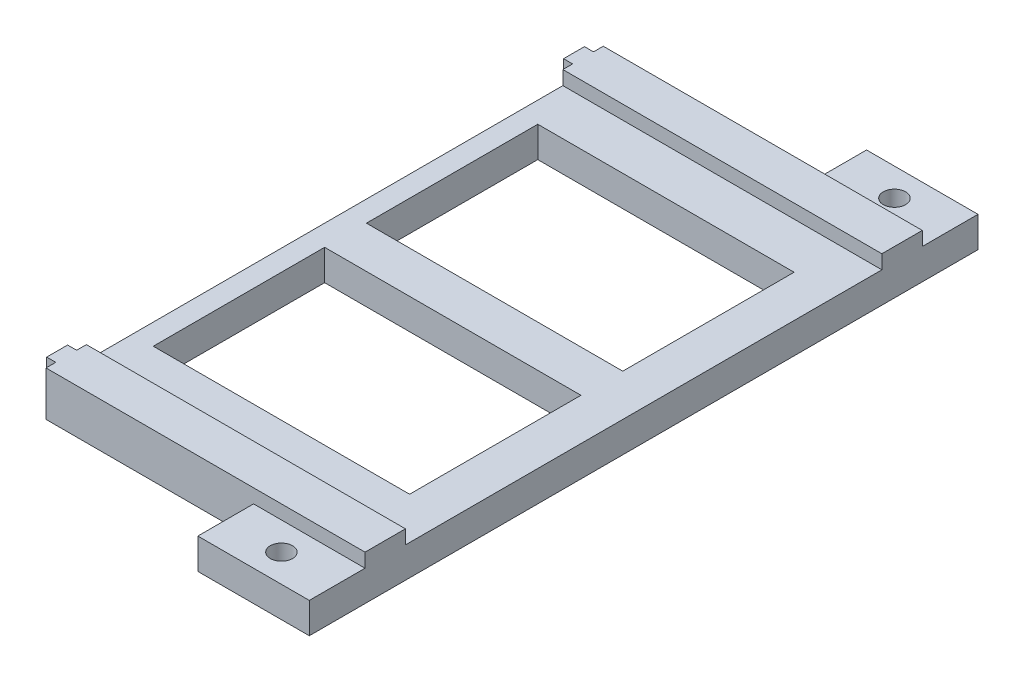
ISO-10303-21;
HEADER;
FILE_DESCRIPTION(('STEP AP214'),'2;1');
FILE_NAME('part.step','',(''),(''),'','','');
FILE_SCHEMA(('AUTOMOTIVE_DESIGN { 1 0 10303 214 1 1 1 1 }'));
ENDSEC;
DATA;
#1=APPLICATION_CONTEXT('core data for automotive mechanical design processes');
#2=APPLICATION_PROTOCOL_DEFINITION('international standard','automotive_design',2000,#1);
#3=PRODUCT_CONTEXT('',#1,'mechanical');
#4=PRODUCT('Part','Part','',(#3));
#5=PRODUCT_RELATED_PRODUCT_CATEGORY('part','',(#4));
#6=PRODUCT_DEFINITION_FORMATION('','',#4);
#7=PRODUCT_DEFINITION_CONTEXT('part definition',#1,'design');
#8=PRODUCT_DEFINITION('design','',#6,#7);
#9=PRODUCT_DEFINITION_SHAPE('','',#8);
#10=(LENGTH_UNIT() NAMED_UNIT(*) SI_UNIT(.MILLI.,.METRE.));
#11=(NAMED_UNIT(*) PLANE_ANGLE_UNIT() SI_UNIT($,.RADIAN.));
#12=(NAMED_UNIT(*) SI_UNIT($,.STERADIAN.) SOLID_ANGLE_UNIT());
#13=UNCERTAINTY_MEASURE_WITH_UNIT(LENGTH_MEASURE(1.E-05),#10,'distance_accuracy_value','');
#14=(GEOMETRIC_REPRESENTATION_CONTEXT(3) GLOBAL_UNCERTAINTY_ASSIGNED_CONTEXT((#13)) GLOBAL_UNIT_ASSIGNED_CONTEXT((#10,
#11,#12)) REPRESENTATION_CONTEXT('',''));
#15=CARTESIAN_POINT('',(0.,0.,0.));
#16=DIRECTION('',(0.,0.,1.));
#17=DIRECTION('',(1.,0.,0.));
#18=AXIS2_PLACEMENT_3D('',#15,#16,#17);
#19=CARTESIAN_POINT('',(70.,0.,122.02168738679));
#20=DIRECTION('',(1.,0.,0.));
#21=DIRECTION('',(0.,0.,-1.));
#22=AXIS2_PLACEMENT_3D('',#19,#20,#21);
#23=PLANE('',#22);
#24=DIRECTION('',(0.,1.,0.));
#25=VECTOR('',#24,1.);
#26=CARTESIAN_POINT('',(70.,-8.17389136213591,-89.));
#27=LINE('',#26,#25);
#28=CARTESIAN_POINT('',(70.,0.,-89.));
#29=VERTEX_POINT('',#28);
#30=CARTESIAN_POINT('',(70.,16.,-89.));
#31=VERTEX_POINT('',#30);
#32=EDGE_CURVE('E277',#29,#31,#27,.T.);
#33=ORIENTED_EDGE('',*,*,#32,.F.);
#34=DIRECTION('',(0.,0.,-1.));
#35=VECTOR('',#34,1.);
#36=CARTESIAN_POINT('',(70.,0.,122.02168738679));
#37=LINE('',#36,#35);
#38=CARTESIAN_POINT('',(70.,0.,89.));
#39=VERTEX_POINT('',#38);
#40=EDGE_CURVE('E321',#39,#29,#37,.T.);
#41=ORIENTED_EDGE('',*,*,#40,.F.);
#42=DIRECTION('',(0.,1.,0.));
#43=VECTOR('',#42,1.);
#44=CARTESIAN_POINT('',(70.,-8.17389136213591,89.));
#45=LINE('',#44,#43);
#46=CARTESIAN_POINT('',(70.,16.,89.));
#47=VERTEX_POINT('',#46);
#48=EDGE_CURVE('E309',#39,#47,#45,.T.);
#49=ORIENTED_EDGE('',*,*,#48,.T.);
#50=DIRECTION('',(0.,0.,1.));
#51=VECTOR('',#50,1.);
#52=CARTESIAN_POINT('',(70.,16.,0.));
#53=LINE('',#52,#51);
#54=CARTESIAN_POINT('',(70.,16.,85.5));
#55=VERTEX_POINT('',#54);
#56=EDGE_CURVE('E325',#55,#47,#53,.T.);
#57=ORIENTED_EDGE('',*,*,#56,.F.);
#58=DIRECTION('',(0.,1.,0.));
#59=VECTOR('',#58,1.);
#60=CARTESIAN_POINT('',(70.,65.,85.5));
#61=LINE('',#60,#59);
#62=CARTESIAN_POINT('',(70.,11.,85.5));
#63=VERTEX_POINT('',#62);
#64=EDGE_CURVE('E11',#63,#55,#61,.T.);
#65=ORIENTED_EDGE('',*,*,#64,.F.);
#66=DIRECTION('',(0.,0.,-1.));
#67=VECTOR('',#66,1.);
#68=CARTESIAN_POINT('',(70.,11.,0.));
#69=LINE('',#68,#67);
#70=CARTESIAN_POINT('',(70.,11.,-85.5));
#71=VERTEX_POINT('',#70);
#72=EDGE_CURVE('E320',#63,#71,#69,.T.);
#73=ORIENTED_EDGE('',*,*,#72,.T.);
#74=DIRECTION('',(0.,1.,0.));
#75=VECTOR('',#74,1.);
#76=CARTESIAN_POINT('',(70.,65.,-85.5));
#77=LINE('',#76,#75);
#78=CARTESIAN_POINT('',(70.,16.,-85.5));
#79=VERTEX_POINT('',#78);
#80=EDGE_CURVE('E329',#71,#79,#77,.T.);
#81=ORIENTED_EDGE('',*,*,#80,.T.);
#82=DIRECTION('',(0.,0.,1.));
#83=VECTOR('',#82,1.);
#84=CARTESIAN_POINT('',(70.,16.,0.));
#85=LINE('',#84,#83);
#86=EDGE_CURVE('E337',#31,#79,#85,.T.);
#87=ORIENTED_EDGE('',*,*,#86,.F.);
#88=EDGE_LOOP('',(#33,#41,#49,#57,#65,#73,#81,#87));
#89=FACE_BOUND('',#88,.T.);
#90=ADVANCED_FACE('F45',(#89),#23,.F.);
#91=DIRECTION('',(0.,1.,0.));
#92=VECTOR('',#91,1.);
#93=CARTESIAN_POINT('',(70.,-8.17389136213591,-96.5));
#94=LINE('',#93,#92);
#95=CARTESIAN_POINT('',(70.,0.,-96.5));
#96=VERTEX_POINT('',#95);
#97=CARTESIAN_POINT('',(70.,16.,-96.5));
#98=VERTEX_POINT('',#97);
#99=EDGE_CURVE('E257',#96,#98,#94,.T.);
#100=ORIENTED_EDGE('',*,*,#99,.T.);
#101=CARTESIAN_POINT('',(70.,16.,-100.));
#102=VERTEX_POINT('',#101);
#103=EDGE_CURVE('E338',#102,#98,#85,.T.);
#104=ORIENTED_EDGE('',*,*,#103,.F.);
#105=DIRECTION('',(0.,1.,0.));
#106=VECTOR('',#105,1.);
#107=CARTESIAN_POINT('',(70.,16.,-100.));
#108=LINE('',#107,#106);
#109=CARTESIAN_POINT('',(70.,0.,-100.));
#110=VERTEX_POINT('',#109);
#111=EDGE_CURVE('E342',#110,#102,#108,.T.);
#112=ORIENTED_EDGE('',*,*,#111,.F.);
#113=EDGE_CURVE('E316',#96,#110,#37,.T.);
#114=ORIENTED_EDGE('',*,*,#113,.F.);
#115=EDGE_LOOP('',(#100,#104,#112,#114));
#116=FACE_BOUND('',#115,.T.);
#117=ADVANCED_FACE('F592',(#116),#23,.F.);
#118=DIRECTION('',(0.,1.,0.));
#119=VECTOR('',#118,1.);
#120=CARTESIAN_POINT('',(70.,-8.17389136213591,96.5));
#121=LINE('',#120,#119);
#122=CARTESIAN_POINT('',(70.,0.,96.5));
#123=VERTEX_POINT('',#122);
#124=CARTESIAN_POINT('',(70.,16.,96.5));
#125=VERTEX_POINT('',#124);
#126=EDGE_CURVE('E301',#123,#125,#121,.T.);
#127=ORIENTED_EDGE('',*,*,#126,.F.);
#128=CARTESIAN_POINT('',(70.,0.,100.));
#129=VERTEX_POINT('',#128);
#130=EDGE_CURVE('E317',#129,#123,#37,.T.);
#131=ORIENTED_EDGE('',*,*,#130,.F.);
#132=DIRECTION('',(0.,-1.,0.));
#133=VECTOR('',#132,1.);
#134=CARTESIAN_POINT('',(70.,16.,100.));
#135=LINE('',#134,#133);
#136=CARTESIAN_POINT('',(70.,16.,100.));
#137=VERTEX_POINT('',#136);
#138=EDGE_CURVE('E333',#137,#129,#135,.T.);
#139=ORIENTED_EDGE('',*,*,#138,.F.);
#140=EDGE_CURVE('E324',#125,#137,#53,.T.);
#141=ORIENTED_EDGE('',*,*,#140,.F.);
#142=EDGE_LOOP('',(#127,#131,#139,#141));
#143=FACE_BOUND('',#142,.T.);
#144=ADVANCED_FACE('F647',(#143),#23,.F.);
#145=CARTESIAN_POINT('',(-184.5,16.,-100.));
#146=DIRECTION('',(0.,0.,1.));
#147=DIRECTION('',(1.,0.,0.));
#148=AXIS2_PLACEMENT_3D('',#145,#146,#147);
#149=PLANE('',#148);
#150=DIRECTION('',(-1.,0.,0.));
#151=VECTOR('',#150,1.);
#152=CARTESIAN_POINT('',(-184.5,0.,-100.));
#153=LINE('',#152,#151);
#154=CARTESIAN_POINT('',(144.5,0.,-100.));
#155=VERTEX_POINT('',#154);
#156=EDGE_CURVE('E559',#155,#110,#153,.T.);
#157=ORIENTED_EDGE('',*,*,#156,.T.);
#158=ORIENTED_EDGE('',*,*,#111,.T.);
#159=DIRECTION('',(-1.,0.,0.));
#160=VECTOR('',#159,1.);
#161=CARTESIAN_POINT('',(-184.5,16.,-100.));
#162=LINE('',#161,#160);
#163=CARTESIAN_POINT('',(184.5,16.,-100.));
#164=VERTEX_POINT('',#163);
#165=EDGE_CURVE('E548',#164,#102,#162,.T.);
#166=ORIENTED_EDGE('',*,*,#165,.F.);
#167=DIRECTION('',(0.,-1.,0.));
#168=VECTOR('',#167,1.);
#169=CARTESIAN_POINT('',(184.5,16.,-100.));
#170=LINE('',#169,#168);
#171=CARTESIAN_POINT('',(184.5,11.,-100.));
#172=VERTEX_POINT('',#171);
#173=EDGE_CURVE('E54',#164,#172,#170,.T.);
#174=ORIENTED_EDGE('',*,*,#173,.T.);
#175=DIRECTION('',(1.,0.,0.));
#176=VECTOR('',#175,1.);
#177=CARTESIAN_POINT('',(184.5,11.,-100.));
#178=LINE('',#177,#176);
#179=CARTESIAN_POINT('',(144.5,11.,-100.));
#180=VERTEX_POINT('',#179);
#181=EDGE_CURVE('E519',#180,#172,#178,.T.);
#182=ORIENTED_EDGE('',*,*,#181,.F.);
#183=DIRECTION('',(0.,1.,0.));
#184=VECTOR('',#183,1.);
#185=CARTESIAN_POINT('',(144.5,0.,-100.));
#186=LINE('',#185,#184);
#187=EDGE_CURVE('E523',#155,#180,#186,.T.);
#188=ORIENTED_EDGE('',*,*,#187,.F.);
#189=EDGE_LOOP('',(#157,#158,#166,#174,#182,#188));
#190=FACE_BOUND('',#189,.T.);
#191=ADVANCED_FACE('F572',(#190),#149,.F.);
#192=CARTESIAN_POINT('',(-52.5,65.,-85.5));
#193=DIRECTION('',(0.,0.,1.));
#194=DIRECTION('',(0.,-1.,0.));
#195=AXIS2_PLACEMENT_3D('',#192,#193,#194);
#196=PLANE('',#195);
#197=ORIENTED_EDGE('',*,*,#80,.F.);
#198=DIRECTION('',(1.,0.,0.));
#199=VECTOR('',#198,1.);
#200=CARTESIAN_POINT('',(-52.5,11.,-85.5));
#201=LINE('',#200,#199);
#202=CARTESIAN_POINT('',(184.5,11.,-85.5));
#203=VERTEX_POINT('',#202);
#204=EDGE_CURVE('E350',#71,#203,#201,.T.);
#205=ORIENTED_EDGE('',*,*,#204,.T.);
#206=DIRECTION('',(0.,-1.,0.));
#207=VECTOR('',#206,1.);
#208=CARTESIAN_POINT('',(184.5,65.,-85.5));
#209=LINE('',#208,#207);
#210=CARTESIAN_POINT('',(184.5,16.,-85.5));
#211=VERTEX_POINT('',#210);
#212=EDGE_CURVE('E346',#211,#203,#209,.T.);
#213=ORIENTED_EDGE('',*,*,#212,.F.);
#214=DIRECTION('',(-1.,0.,0.));
#215=VECTOR('',#214,1.);
#216=CARTESIAN_POINT('',(0.,16.,-85.5));
#217=LINE('',#216,#215);
#218=EDGE_CURVE('E353',#211,#79,#217,.T.);
#219=ORIENTED_EDGE('',*,*,#218,.T.);
#220=EDGE_LOOP('',(#197,#205,#213,#219));
#221=FACE_BOUND('',#220,.T.);
#222=ADVANCED_FACE('F616',(#221),#196,.T.);
#223=CARTESIAN_POINT('',(0.,16.,0.));
#224=DIRECTION('',(0.,-1.,0.));
#225=DIRECTION('',(0.,0.,-1.));
#226=AXIS2_PLACEMENT_3D('',#223,#224,#225);
#227=PLANE('',#226);
#228=ORIENTED_EDGE('',*,*,#165,.T.);
#229=ORIENTED_EDGE('',*,*,#103,.T.);
#230=DIRECTION('',(1.,0.,0.));
#231=VECTOR('',#230,1.);
#232=CARTESIAN_POINT('',(70.,16.,-96.5));
#233=LINE('',#232,#231);
#234=CARTESIAN_POINT('',(66.75,16.,-96.5));
#235=VERTEX_POINT('',#234);
#236=EDGE_CURVE('E253',#235,#98,#233,.T.);
#237=ORIENTED_EDGE('',*,*,#236,.F.);
#238=DIRECTION('',(0.,0.,-1.));
#239=VECTOR('',#238,1.);
#240=CARTESIAN_POINT('',(66.75,16.,-89.));
#241=LINE('',#240,#239);
#242=CARTESIAN_POINT('',(66.75,16.,-89.));
#243=VERTEX_POINT('',#242);
#244=EDGE_CURVE('E249',#243,#235,#241,.T.);
#245=ORIENTED_EDGE('',*,*,#244,.F.);
#246=DIRECTION('',(-1.,0.,0.));
#247=VECTOR('',#246,1.);
#248=CARTESIAN_POINT('',(70.,16.,-89.));
#249=LINE('',#248,#247);
#250=EDGE_CURVE('E280',#31,#243,#249,.T.);
#251=ORIENTED_EDGE('',*,*,#250,.F.);
#252=ORIENTED_EDGE('',*,*,#86,.T.);
#253=ORIENTED_EDGE('',*,*,#218,.F.);
#254=DIRECTION('',(0.,0.,-1.));
#255=VECTOR('',#254,1.);
#256=CARTESIAN_POINT('',(184.5,16.,100.));
#257=LINE('',#256,#255);
#258=EDGE_CURVE('E549',#211,#164,#257,.T.);
#259=ORIENTED_EDGE('',*,*,#258,.T.);
#260=EDGE_LOOP('',(#228,#229,#237,#245,#251,#252,#253,#259));
#261=FACE_BOUND('',#260,.T.);
#262=ADVANCED_FACE('F594',(#261),#227,.F.);
#263=CARTESIAN_POINT('',(184.5,16.,100.));
#264=DIRECTION('',(-1.,0.,0.));
#265=DIRECTION('',(0.,0.,1.));
#266=AXIS2_PLACEMENT_3D('',#263,#264,#265);
#267=PLANE('',#266);
#268=ORIENTED_EDGE('',*,*,#212,.T.);
#269=DIRECTION('',(0.,0.,-1.));
#270=VECTOR('',#269,1.);
#271=CARTESIAN_POINT('',(184.5,11.,-84.));
#272=LINE('',#271,#270);
#273=CARTESIAN_POINT('',(184.5,11.,85.5));
#274=VERTEX_POINT('',#273);
#275=EDGE_CURVE('E528',#274,#203,#272,.T.);
#276=ORIENTED_EDGE('',*,*,#275,.F.);
#277=DIRECTION('',(0.,-1.,0.));
#278=VECTOR('',#277,1.);
#279=CARTESIAN_POINT('',(184.5,65.,85.5));
#280=LINE('',#279,#278);
#281=CARTESIAN_POINT('',(184.5,16.,85.5));
#282=VERTEX_POINT('',#281);
#283=EDGE_CURVE('E357',#282,#274,#280,.T.);
#284=ORIENTED_EDGE('',*,*,#283,.F.);
#285=CARTESIAN_POINT('',(184.5,16.,100.));
#286=VERTEX_POINT('',#285);
#287=EDGE_CURVE('E544',#286,#282,#257,.T.);
#288=ORIENTED_EDGE('',*,*,#287,.F.);
#289=DIRECTION('',(0.,-1.,0.));
#290=VECTOR('',#289,1.);
#291=CARTESIAN_POINT('',(184.5,16.,100.));
#292=LINE('',#291,#290);
#293=CARTESIAN_POINT('',(184.5,11.,100.));
#294=VERTEX_POINT('',#293);
#295=EDGE_CURVE('E556',#286,#294,#292,.T.);
#296=ORIENTED_EDGE('',*,*,#295,.T.);
#297=DIRECTION('',(0.,0.,-1.));
#298=VECTOR('',#297,1.);
#299=CARTESIAN_POINT('',(184.5,11.,120.));
#300=LINE('',#299,#298);
#301=CARTESIAN_POINT('',(184.5,11.,120.));
#302=VERTEX_POINT('',#301);
#303=EDGE_CURVE('E494',#302,#294,#300,.T.);
#304=ORIENTED_EDGE('',*,*,#303,.F.);
#305=DIRECTION('',(0.,-1.,0.));
#306=VECTOR('',#305,1.);
#307=CARTESIAN_POINT('',(184.5,0.,120.));
#308=LINE('',#307,#306);
#309=CARTESIAN_POINT('',(184.5,0.,120.));
#310=VERTEX_POINT('',#309);
#311=EDGE_CURVE('E465',#302,#310,#308,.T.);
#312=ORIENTED_EDGE('',*,*,#311,.T.);
#313=DIRECTION('',(0.,0.,-1.));
#314=VECTOR('',#313,1.);
#315=CARTESIAN_POINT('',(184.5,0.,100.));
#316=LINE('',#315,#314);
#317=CARTESIAN_POINT('',(184.5,0.,-120.));
#318=VERTEX_POINT('',#317);
#319=EDGE_CURVE('E543',#310,#318,#316,.T.);
#320=ORIENTED_EDGE('',*,*,#319,.T.);
#321=DIRECTION('',(0.,-1.,0.));
#322=VECTOR('',#321,1.);
#323=CARTESIAN_POINT('',(184.5,0.,-120.));
#324=LINE('',#323,#322);
#325=CARTESIAN_POINT('',(184.5,11.,-120.));
#326=VERTEX_POINT('',#325);
#327=EDGE_CURVE('E524',#326,#318,#324,.T.);
#328=ORIENTED_EDGE('',*,*,#327,.F.);
#329=DIRECTION('',(0.,0.,1.));
#330=VECTOR('',#329,1.);
#331=CARTESIAN_POINT('',(184.5,11.,-120.));
#332=LINE('',#331,#330);
#333=EDGE_CURVE('E514',#326,#172,#332,.T.);
#334=ORIENTED_EDGE('',*,*,#333,.T.);
#335=ORIENTED_EDGE('',*,*,#173,.F.);
#336=ORIENTED_EDGE('',*,*,#258,.F.);
#337=EDGE_LOOP('',(#268,#276,#284,#288,#296,#304,#312,#320,#328,#334,#335,#336));
#338=FACE_BOUND('',#337,.T.);
#339=ADVANCED_FACE('F47',(#338),#267,.F.);
#340=DIRECTION('',(-1.,0.,0.));
#341=VECTOR('',#340,1.);
#342=CARTESIAN_POINT('',(0.,16.,85.5));
#343=LINE('',#342,#341);
#344=EDGE_CURVE('E364',#282,#55,#343,.T.);
#345=ORIENTED_EDGE('',*,*,#344,.T.);
#346=ORIENTED_EDGE('',*,*,#56,.T.);
#347=DIRECTION('',(-1.,0.,0.));
#348=VECTOR('',#347,1.);
#349=CARTESIAN_POINT('',(70.,16.,89.));
#350=LINE('',#349,#348);
#351=CARTESIAN_POINT('',(66.75,16.,89.));
#352=VERTEX_POINT('',#351);
#353=EDGE_CURVE('E69',#47,#352,#350,.T.);
#354=ORIENTED_EDGE('',*,*,#353,.T.);
#355=DIRECTION('',(0.,0.,1.));
#356=VECTOR('',#355,1.);
#357=CARTESIAN_POINT('',(66.75,16.,89.));
#358=LINE('',#357,#356);
#359=CARTESIAN_POINT('',(66.75,16.,96.5));
#360=VERTEX_POINT('',#359);
#361=EDGE_CURVE('E271',#352,#360,#358,.T.);
#362=ORIENTED_EDGE('',*,*,#361,.T.);
#363=DIRECTION('',(1.,0.,0.));
#364=VECTOR('',#363,1.);
#365=CARTESIAN_POINT('',(70.,16.,96.5));
#366=LINE('',#365,#364);
#367=EDGE_CURVE('E286',#360,#125,#366,.T.);
#368=ORIENTED_EDGE('',*,*,#367,.T.);
#369=ORIENTED_EDGE('',*,*,#140,.T.);
#370=DIRECTION('',(1.,0.,0.));
#371=VECTOR('',#370,1.);
#372=CARTESIAN_POINT('',(-184.5,16.,100.));
#373=LINE('',#372,#371);
#374=EDGE_CURVE('E553',#137,#286,#373,.T.);
#375=ORIENTED_EDGE('',*,*,#374,.T.);
#376=ORIENTED_EDGE('',*,*,#287,.T.);
#377=EDGE_LOOP('',(#345,#346,#354,#362,#368,#369,#375,#376));
#378=FACE_BOUND('',#377,.T.);
#379=ADVANCED_FACE('F625',(#378),#227,.F.);
#380=CARTESIAN_POINT('',(-184.5,16.,100.));
#381=DIRECTION('',(0.,0.,-1.));
#382=DIRECTION('',(-1.,0.,0.));
#383=AXIS2_PLACEMENT_3D('',#380,#381,#382);
#384=PLANE('',#383);
#385=ORIENTED_EDGE('',*,*,#374,.F.);
#386=ORIENTED_EDGE('',*,*,#138,.T.);
#387=DIRECTION('',(1.,0.,0.));
#388=VECTOR('',#387,1.);
#389=CARTESIAN_POINT('',(-184.5,0.,100.));
#390=LINE('',#389,#388);
#391=CARTESIAN_POINT('',(144.5,0.,100.));
#392=VERTEX_POINT('',#391);
#393=EDGE_CURVE('E563',#129,#392,#390,.T.);
#394=ORIENTED_EDGE('',*,*,#393,.T.);
#395=DIRECTION('',(0.,1.,0.));
#396=VECTOR('',#395,1.);
#397=CARTESIAN_POINT('',(144.5,0.,100.));
#398=LINE('',#397,#396);
#399=CARTESIAN_POINT('',(144.5,11.,100.));
#400=VERTEX_POINT('',#399);
#401=EDGE_CURVE('E470',#392,#400,#398,.T.);
#402=ORIENTED_EDGE('',*,*,#401,.T.);
#403=DIRECTION('',(1.,0.,0.));
#404=VECTOR('',#403,1.);
#405=CARTESIAN_POINT('',(184.5,11.,100.));
#406=LINE('',#405,#404);
#407=EDGE_CURVE('E461',#400,#294,#406,.T.);
#408=ORIENTED_EDGE('',*,*,#407,.T.);
#409=ORIENTED_EDGE('',*,*,#295,.F.);
#410=EDGE_LOOP('',(#385,#386,#394,#402,#408,#409));
#411=FACE_BOUND('',#410,.T.);
#412=ADVANCED_FACE('F642',(#411),#384,.F.);
#413=CARTESIAN_POINT('',(0.,0.,0.));
#414=DIRECTION('',(0.,-1.,0.));
#415=DIRECTION('',(0.,0.,-1.));
#416=AXIS2_PLACEMENT_3D('',#413,#414,#415);
#417=PLANE('',#416);
#418=ORIENTED_EDGE('',*,*,#130,.T.);
#419=DIRECTION('',(1.,0.,0.));
#420=VECTOR('',#419,1.);
#421=CARTESIAN_POINT('',(70.,0.,96.5));
#422=LINE('',#421,#420);
#423=CARTESIAN_POINT('',(66.75,0.,96.5));
#424=VERTEX_POINT('',#423);
#425=EDGE_CURVE('E298',#424,#123,#422,.T.);
#426=ORIENTED_EDGE('',*,*,#425,.F.);
#427=DIRECTION('',(0.,0.,1.));
#428=VECTOR('',#427,1.);
#429=CARTESIAN_POINT('',(66.75,0.,89.));
#430=LINE('',#429,#428);
#431=CARTESIAN_POINT('',(66.75,0.,89.));
#432=VERTEX_POINT('',#431);
#433=EDGE_CURVE('E303',#432,#424,#430,.T.);
#434=ORIENTED_EDGE('',*,*,#433,.F.);
#435=DIRECTION('',(-1.,0.,0.));
#436=VECTOR('',#435,1.);
#437=CARTESIAN_POINT('',(70.,0.,89.));
#438=LINE('',#437,#436);
#439=EDGE_CURVE('E290',#39,#432,#438,.T.);
#440=ORIENTED_EDGE('',*,*,#439,.F.);
#441=ORIENTED_EDGE('',*,*,#40,.T.);
#442=DIRECTION('',(-1.,0.,0.));
#443=VECTOR('',#442,1.);
#444=CARTESIAN_POINT('',(70.,0.,-89.));
#445=LINE('',#444,#443);
#446=CARTESIAN_POINT('',(66.75,0.,-89.));
#447=VERTEX_POINT('',#446);
#448=EDGE_CURVE('E260',#29,#447,#445,.T.);
#449=ORIENTED_EDGE('',*,*,#448,.T.);
#450=DIRECTION('',(0.,0.,-1.));
#451=VECTOR('',#450,1.);
#452=CARTESIAN_POINT('',(66.75,0.,-89.));
#453=LINE('',#452,#451);
#454=CARTESIAN_POINT('',(66.75,0.,-96.5));
#455=VERTEX_POINT('',#454);
#456=EDGE_CURVE('E246',#447,#455,#453,.T.);
#457=ORIENTED_EDGE('',*,*,#456,.T.);
#458=DIRECTION('',(1.,0.,0.));
#459=VECTOR('',#458,1.);
#460=CARTESIAN_POINT('',(70.,0.,-96.5));
#461=LINE('',#460,#459);
#462=EDGE_CURVE('E61',#455,#96,#461,.T.);
#463=ORIENTED_EDGE('',*,*,#462,.T.);
#464=ORIENTED_EDGE('',*,*,#113,.T.);
#465=ORIENTED_EDGE('',*,*,#156,.F.);
#466=DIRECTION('',(0.,0.,1.));
#467=VECTOR('',#466,1.);
#468=CARTESIAN_POINT('',(144.5,0.,-120.));
#469=LINE('',#468,#467);
#470=CARTESIAN_POINT('',(144.5,0.,-120.));
#471=VERTEX_POINT('',#470);
#472=EDGE_CURVE('E503',#471,#155,#469,.T.);
#473=ORIENTED_EDGE('',*,*,#472,.F.);
#474=DIRECTION('',(-1.,0.,0.));
#475=VECTOR('',#474,1.);
#476=CARTESIAN_POINT('',(184.5,0.,-120.));
#477=LINE('',#476,#475);
#478=EDGE_CURVE('E534',#318,#471,#477,.T.);
#479=ORIENTED_EDGE('',*,*,#478,.F.);
#480=ORIENTED_EDGE('',*,*,#319,.F.);
#481=DIRECTION('',(-1.,0.,0.));
#482=VECTOR('',#481,1.);
#483=CARTESIAN_POINT('',(184.5,0.,120.));
#484=LINE('',#483,#482);
#485=CARTESIAN_POINT('',(144.5,0.,120.));
#486=VERTEX_POINT('',#485);
#487=EDGE_CURVE('E478',#310,#486,#484,.T.);
#488=ORIENTED_EDGE('',*,*,#487,.T.);
#489=DIRECTION('',(0.,0.,-1.));
#490=VECTOR('',#489,1.);
#491=CARTESIAN_POINT('',(144.5,0.,120.));
#492=LINE('',#491,#490);
#493=EDGE_CURVE('E482',#486,#392,#492,.T.);
#494=ORIENTED_EDGE('',*,*,#493,.T.);
#495=ORIENTED_EDGE('',*,*,#393,.F.);
#496=EDGE_LOOP('',(#418,#426,#434,#440,#441,#449,#457,#463,#464,#465,#473,#479,#480,#488,#494,#495));
#497=FACE_BOUND('',#496,.T.);
#498=DIRECTION('',(0.,0.,1.));
#499=VECTOR('',#498,1.);
#500=CARTESIAN_POINT('',(77.5,0.,-69.));
#501=LINE('',#500,#499);
#502=CARTESIAN_POINT('',(77.5,0.,-69.));
#503=VERTEX_POINT('',#502);
#504=CARTESIAN_POINT('',(77.5,0.,-7.5));
#505=VERTEX_POINT('',#504);
#506=EDGE_CURVE('E431',#503,#505,#501,.T.);
#507=ORIENTED_EDGE('',*,*,#506,.T.);
#508=DIRECTION('',(1.,0.,0.));
#509=VECTOR('',#508,1.);
#510=CARTESIAN_POINT('',(77.5,0.,-7.5));
#511=LINE('',#510,#509);
#512=CARTESIAN_POINT('',(169.5,0.,-7.5));
#513=VERTEX_POINT('',#512);
#514=EDGE_CURVE('E450',#505,#513,#511,.T.);
#515=ORIENTED_EDGE('',*,*,#514,.T.);
#516=DIRECTION('',(0.,0.,-1.));
#517=VECTOR('',#516,1.);
#518=CARTESIAN_POINT('',(169.5,0.,-69.));
#519=LINE('',#518,#517);
#520=CARTESIAN_POINT('',(169.5,0.,-69.));
#521=VERTEX_POINT('',#520);
#522=EDGE_CURVE('E446',#513,#521,#519,.T.);
#523=ORIENTED_EDGE('',*,*,#522,.T.);
#524=DIRECTION('',(-1.,0.,0.));
#525=VECTOR('',#524,1.);
#526=CARTESIAN_POINT('',(77.5,0.,-69.));
#527=LINE('',#526,#525);
#528=EDGE_CURVE('E417',#521,#503,#527,.T.);
#529=ORIENTED_EDGE('',*,*,#528,.T.);
#530=EDGE_LOOP('',(#507,#515,#523,#529));
#531=FACE_BOUND('',#530,.T.);
#532=DIRECTION('',(0.,0.,1.));
#533=VECTOR('',#532,1.);
#534=CARTESIAN_POINT('',(77.5,0.,7.5));
#535=LINE('',#534,#533);
#536=CARTESIAN_POINT('',(77.5,0.,7.5));
#537=VERTEX_POINT('',#536);
#538=CARTESIAN_POINT('',(77.5,0.,69.));
#539=VERTEX_POINT('',#538);
#540=EDGE_CURVE('E387',#537,#539,#535,.T.);
#541=ORIENTED_EDGE('',*,*,#540,.T.);
#542=DIRECTION('',(1.,0.,0.));
#543=VECTOR('',#542,1.);
#544=CARTESIAN_POINT('',(77.5,0.,69.));
#545=LINE('',#544,#543);
#546=CARTESIAN_POINT('',(169.5,0.,69.));
#547=VERTEX_POINT('',#546);
#548=EDGE_CURVE('E406',#539,#547,#545,.T.);
#549=ORIENTED_EDGE('',*,*,#548,.T.);
#550=DIRECTION('',(0.,0.,-1.));
#551=VECTOR('',#550,1.);
#552=CARTESIAN_POINT('',(169.5,0.,7.5));
#553=LINE('',#552,#551);
#554=CARTESIAN_POINT('',(169.5,0.,7.5));
#555=VERTEX_POINT('',#554);
#556=EDGE_CURVE('E402',#547,#555,#553,.T.);
#557=ORIENTED_EDGE('',*,*,#556,.T.);
#558=DIRECTION('',(-1.,0.,0.));
#559=VECTOR('',#558,1.);
#560=CARTESIAN_POINT('',(77.5,0.,7.5));
#561=LINE('',#560,#559);
#562=EDGE_CURVE('E373',#555,#537,#561,.T.);
#563=ORIENTED_EDGE('',*,*,#562,.T.);
#564=EDGE_LOOP('',(#541,#549,#557,#563));
#565=FACE_BOUND('',#564,.T.);
#566=CARTESIAN_POINT('',(164.5,0.,110.));
#567=DIRECTION('',(0.,-1.,0.));
#568=DIRECTION('',(0.,0.,-1.));
#569=AXIS2_PLACEMENT_3D('',#566,#567,#568);
#570=CIRCLE('',#569,3.99999999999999);
#571=CARTESIAN_POINT('',(164.5,0.,106.));
#572=VERTEX_POINT('',#571);
#573=EDGE_CURVE('E457',#572,#572,#570,.T.);
#574=ORIENTED_EDGE('',*,*,#573,.F.);
#575=EDGE_LOOP('',(#574));
#576=FACE_BOUND('',#575,.T.);
#577=CARTESIAN_POINT('',(164.5,0.,-110.));
#578=DIRECTION('',(0.,1.,0.));
#579=DIRECTION('',(0.,0.,1.));
#580=AXIS2_PLACEMENT_3D('',#577,#578,#579);
#581=CIRCLE('',#580,3.99999999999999);
#582=CARTESIAN_POINT('',(164.5,0.,-106.));
#583=VERTEX_POINT('',#582);
#584=EDGE_CURVE('E499',#583,#583,#581,.T.);
#585=ORIENTED_EDGE('',*,*,#584,.T.);
#586=EDGE_LOOP('',(#585));
#587=FACE_BOUND('',#586,.T.);
#588=ADVANCED_FACE('F264',(#497,#531,#565,#576,#587),#417,.T.);
#589=CARTESIAN_POINT('',(0.,11.,0.));
#590=DIRECTION('',(0.,1.,0.));
#591=DIRECTION('',(0.,0.,1.));
#592=AXIS2_PLACEMENT_3D('',#589,#590,#591);
#593=PLANE('',#592);
#594=ORIENTED_EDGE('',*,*,#72,.F.);
#595=DIRECTION('',(1.,0.,0.));
#596=VECTOR('',#595,1.);
#597=CARTESIAN_POINT('',(-52.5,11.,85.5));
#598=LINE('',#597,#596);
#599=EDGE_CURVE('E361',#63,#274,#598,.T.);
#600=ORIENTED_EDGE('',*,*,#599,.T.);
#601=ORIENTED_EDGE('',*,*,#275,.T.);
#602=ORIENTED_EDGE('',*,*,#204,.F.);
#603=EDGE_LOOP('',(#594,#600,#601,#602));
#604=FACE_BOUND('',#603,.T.);
#605=DIRECTION('',(0.,0.,1.));
#606=VECTOR('',#605,1.);
#607=CARTESIAN_POINT('',(77.5,11.,-69.));
#608=LINE('',#607,#606);
#609=CARTESIAN_POINT('',(77.5,11.,-69.));
#610=VERTEX_POINT('',#609);
#611=CARTESIAN_POINT('',(77.5,11.,-7.5));
#612=VERTEX_POINT('',#611);
#613=EDGE_CURVE('E439',#610,#612,#608,.T.);
#614=ORIENTED_EDGE('',*,*,#613,.F.);
#615=DIRECTION('',(-1.,0.,0.));
#616=VECTOR('',#615,1.);
#617=CARTESIAN_POINT('',(77.5,11.,-69.));
#618=LINE('',#617,#616);
#619=CARTESIAN_POINT('',(169.5,11.,-69.));
#620=VERTEX_POINT('',#619);
#621=EDGE_CURVE('E426',#620,#610,#618,.T.);
#622=ORIENTED_EDGE('',*,*,#621,.F.);
#623=DIRECTION('',(0.,0.,-1.));
#624=VECTOR('',#623,1.);
#625=CARTESIAN_POINT('',(169.5,11.,-69.));
#626=LINE('',#625,#624);
#627=CARTESIAN_POINT('',(169.5,11.,-7.5));
#628=VERTEX_POINT('',#627);
#629=EDGE_CURVE('E430',#628,#620,#626,.T.);
#630=ORIENTED_EDGE('',*,*,#629,.F.);
#631=DIRECTION('',(1.,0.,0.));
#632=VECTOR('',#631,1.);
#633=CARTESIAN_POINT('',(77.5,11.,-7.5));
#634=LINE('',#633,#632);
#635=EDGE_CURVE('E435',#612,#628,#634,.T.);
#636=ORIENTED_EDGE('',*,*,#635,.F.);
#637=EDGE_LOOP('',(#614,#622,#630,#636));
#638=FACE_BOUND('',#637,.T.);
#639=DIRECTION('',(0.,0.,1.));
#640=VECTOR('',#639,1.);
#641=CARTESIAN_POINT('',(77.5,11.,7.5));
#642=LINE('',#641,#640);
#643=CARTESIAN_POINT('',(77.5,11.,7.5));
#644=VERTEX_POINT('',#643);
#645=CARTESIAN_POINT('',(77.5,11.,69.));
#646=VERTEX_POINT('',#645);
#647=EDGE_CURVE('E395',#644,#646,#642,.T.);
#648=ORIENTED_EDGE('',*,*,#647,.F.);
#649=DIRECTION('',(-1.,0.,0.));
#650=VECTOR('',#649,1.);
#651=CARTESIAN_POINT('',(77.5,11.,7.5));
#652=LINE('',#651,#650);
#653=CARTESIAN_POINT('',(169.5,11.,7.5));
#654=VERTEX_POINT('',#653);
#655=EDGE_CURVE('E382',#654,#644,#652,.T.);
#656=ORIENTED_EDGE('',*,*,#655,.F.);
#657=DIRECTION('',(0.,0.,-1.));
#658=VECTOR('',#657,1.);
#659=CARTESIAN_POINT('',(169.5,11.,7.5));
#660=LINE('',#659,#658);
#661=CARTESIAN_POINT('',(169.5,11.,69.));
#662=VERTEX_POINT('',#661);
#663=EDGE_CURVE('E386',#662,#654,#660,.T.);
#664=ORIENTED_EDGE('',*,*,#663,.F.);
#665=DIRECTION('',(1.,0.,0.));
#666=VECTOR('',#665,1.);
#667=CARTESIAN_POINT('',(77.5,11.,69.));
#668=LINE('',#667,#666);
#669=EDGE_CURVE('E391',#646,#662,#668,.T.);
#670=ORIENTED_EDGE('',*,*,#669,.F.);
#671=EDGE_LOOP('',(#648,#656,#664,#670));
#672=FACE_BOUND('',#671,.T.);
#673=ADVANCED_FACE('F687',(#604,#638,#672),#593,.T.);
#674=CARTESIAN_POINT('',(144.5,0.,-120.));
#675=DIRECTION('',(1.,0.,0.));
#676=DIRECTION('',(0.,0.,-1.));
#677=AXIS2_PLACEMENT_3D('',#674,#675,#676);
#678=PLANE('',#677);
#679=ORIENTED_EDGE('',*,*,#187,.T.);
#680=DIRECTION('',(0.,0.,1.));
#681=VECTOR('',#680,1.);
#682=CARTESIAN_POINT('',(144.5,11.,-120.));
#683=LINE('',#682,#681);
#684=CARTESIAN_POINT('',(144.5,11.,-120.));
#685=VERTEX_POINT('',#684);
#686=EDGE_CURVE('E510',#685,#180,#683,.T.);
#687=ORIENTED_EDGE('',*,*,#686,.F.);
#688=DIRECTION('',(0.,1.,0.));
#689=VECTOR('',#688,1.);
#690=CARTESIAN_POINT('',(144.5,0.,-120.));
#691=LINE('',#690,#689);
#692=EDGE_CURVE('E531',#471,#685,#691,.T.);
#693=ORIENTED_EDGE('',*,*,#692,.F.);
#694=ORIENTED_EDGE('',*,*,#472,.T.);
#695=EDGE_LOOP('',(#679,#687,#693,#694));
#696=FACE_BOUND('',#695,.T.);
#697=ADVANCED_FACE('F588',(#696),#678,.F.);
#698=CARTESIAN_POINT('',(184.5,11.,-120.));
#699=DIRECTION('',(0.,-1.,0.));
#700=DIRECTION('',(0.,0.,-1.));
#701=AXIS2_PLACEMENT_3D('',#698,#699,#700);
#702=PLANE('',#701);
#703=CARTESIAN_POINT('',(164.5,11.,-110.));
#704=DIRECTION('',(0.,1.,0.));
#705=DIRECTION('',(0.,0.,1.));
#706=AXIS2_PLACEMENT_3D('',#703,#704,#705);
#707=CIRCLE('',#706,3.99999999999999);
#708=CARTESIAN_POINT('',(164.5,11.,-106.));
#709=VERTEX_POINT('',#708);
#710=EDGE_CURVE('E498',#709,#709,#707,.T.);
#711=ORIENTED_EDGE('',*,*,#710,.F.);
#712=EDGE_LOOP('',(#711));
#713=FACE_BOUND('',#712,.T.);
#714=ORIENTED_EDGE('',*,*,#181,.T.);
#715=ORIENTED_EDGE('',*,*,#333,.F.);
#716=DIRECTION('',(1.,0.,0.));
#717=VECTOR('',#716,1.);
#718=CARTESIAN_POINT('',(184.5,11.,-120.));
#719=LINE('',#718,#717);
#720=EDGE_CURVE('E518',#685,#326,#719,.T.);
#721=ORIENTED_EDGE('',*,*,#720,.F.);
#722=ORIENTED_EDGE('',*,*,#686,.T.);
#723=EDGE_LOOP('',(#714,#715,#721,#722));
#724=FACE_BOUND('',#723,.T.);
#725=ADVANCED_FACE('F578',(#713,#724),#702,.F.);
#726=CARTESIAN_POINT('',(0.,0.,-120.));
#727=DIRECTION('',(0.,0.,1.));
#728=DIRECTION('',(1.,0.,0.));
#729=AXIS2_PLACEMENT_3D('',#726,#727,#728);
#730=PLANE('',#729);
#731=ORIENTED_EDGE('',*,*,#327,.T.);
#732=ORIENTED_EDGE('',*,*,#478,.T.);
#733=ORIENTED_EDGE('',*,*,#692,.T.);
#734=ORIENTED_EDGE('',*,*,#720,.T.);
#735=EDGE_LOOP('',(#731,#732,#733,#734));
#736=FACE_BOUND('',#735,.T.);
#737=ADVANCED_FACE('F584',(#736),#730,.F.);
#738=CARTESIAN_POINT('',(164.5,0.,-110.));
#739=DIRECTION('',(0.,1.,0.));
#740=DIRECTION('',(0.,0.,1.));
#741=AXIS2_PLACEMENT_3D('',#738,#739,#740);
#742=CYLINDRICAL_SURFACE('',#741,3.99999999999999);
#743=ORIENTED_EDGE('',*,*,#584,.F.);
#744=EDGE_LOOP('',(#743));
#745=FACE_BOUND('',#744,.T.);
#746=ORIENTED_EDGE('',*,*,#710,.T.);
#747=EDGE_LOOP('',(#746));
#748=FACE_BOUND('',#747,.T.);
#749=ADVANCED_FACE('F693',(#745,#748),#742,.F.);
#750=CARTESIAN_POINT('',(184.5,11.,120.));
#751=DIRECTION('',(0.,1.,0.));
#752=DIRECTION('',(0.,0.,1.));
#753=AXIS2_PLACEMENT_3D('',#750,#751,#752);
#754=PLANE('',#753);
#755=CARTESIAN_POINT('',(164.5,11.,110.));
#756=DIRECTION('',(0.,-1.,0.));
#757=DIRECTION('',(0.,0.,-1.));
#758=AXIS2_PLACEMENT_3D('',#755,#756,#757);
#759=CIRCLE('',#758,3.99999999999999);
#760=CARTESIAN_POINT('',(164.5,11.,106.));
#761=VERTEX_POINT('',#760);
#762=EDGE_CURVE('E442',#761,#761,#759,.T.);
#763=ORIENTED_EDGE('',*,*,#762,.T.);
#764=EDGE_LOOP('',(#763));
#765=FACE_BOUND('',#764,.T.);
#766=ORIENTED_EDGE('',*,*,#407,.F.);
#767=DIRECTION('',(0.,0.,-1.));
#768=VECTOR('',#767,1.);
#769=CARTESIAN_POINT('',(144.5,11.,120.));
#770=LINE('',#769,#768);
#771=CARTESIAN_POINT('',(144.5,11.,120.));
#772=VERTEX_POINT('',#771);
#773=EDGE_CURVE('E490',#772,#400,#770,.T.);
#774=ORIENTED_EDGE('',*,*,#773,.F.);
#775=DIRECTION('',(1.,0.,0.));
#776=VECTOR('',#775,1.);
#777=CARTESIAN_POINT('',(184.5,11.,120.));
#778=LINE('',#777,#776);
#779=EDGE_CURVE('E469',#772,#302,#778,.T.);
#780=ORIENTED_EDGE('',*,*,#779,.T.);
#781=ORIENTED_EDGE('',*,*,#303,.T.);
#782=EDGE_LOOP('',(#766,#774,#780,#781));
#783=FACE_BOUND('',#782,.T.);
#784=ADVANCED_FACE('F632',(#765,#783),#754,.T.);
#785=CARTESIAN_POINT('',(144.5,0.,120.));
#786=DIRECTION('',(-1.,0.,0.));
#787=DIRECTION('',(0.,0.,1.));
#788=AXIS2_PLACEMENT_3D('',#785,#786,#787);
#789=PLANE('',#788);
#790=ORIENTED_EDGE('',*,*,#401,.F.);
#791=ORIENTED_EDGE('',*,*,#493,.F.);
#792=DIRECTION('',(0.,1.,0.));
#793=VECTOR('',#792,1.);
#794=CARTESIAN_POINT('',(144.5,0.,120.));
#795=LINE('',#794,#793);
#796=EDGE_CURVE('E474',#486,#772,#795,.T.);
#797=ORIENTED_EDGE('',*,*,#796,.T.);
#798=ORIENTED_EDGE('',*,*,#773,.T.);
#799=EDGE_LOOP('',(#790,#791,#797,#798));
#800=FACE_BOUND('',#799,.T.);
#801=ADVANCED_FACE('F640',(#800),#789,.T.);
#802=CARTESIAN_POINT('',(0.,0.,120.));
#803=DIRECTION('',(0.,0.,-1.));
#804=DIRECTION('',(1.,0.,0.));
#805=AXIS2_PLACEMENT_3D('',#802,#803,#804);
#806=PLANE('',#805);
#807=ORIENTED_EDGE('',*,*,#311,.F.);
#808=ORIENTED_EDGE('',*,*,#779,.F.);
#809=ORIENTED_EDGE('',*,*,#796,.F.);
#810=ORIENTED_EDGE('',*,*,#487,.F.);
#811=EDGE_LOOP('',(#807,#808,#809,#810));
#812=FACE_BOUND('',#811,.T.);
#813=ADVANCED_FACE('F636',(#812),#806,.F.);
#814=CARTESIAN_POINT('',(164.5,0.,110.));
#815=DIRECTION('',(0.,1.,0.));
#816=DIRECTION('',(0.,0.,1.));
#817=AXIS2_PLACEMENT_3D('',#814,#815,#816);
#818=CYLINDRICAL_SURFACE('',#817,3.99999999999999);
#819=ORIENTED_EDGE('',*,*,#573,.T.);
#820=EDGE_LOOP('',(#819));
#821=FACE_BOUND('',#820,.T.);
#822=ORIENTED_EDGE('',*,*,#762,.F.);
#823=EDGE_LOOP('',(#822));
#824=FACE_BOUND('',#823,.T.);
#825=ADVANCED_FACE('F709',(#821,#824),#818,.F.);
#826=CARTESIAN_POINT('',(77.5,0.,7.5));
#827=DIRECTION('',(-1.,0.,0.));
#828=DIRECTION('',(0.,0.,1.));
#829=AXIS2_PLACEMENT_3D('',#826,#827,#828);
#830=PLANE('',#829);
#831=ORIENTED_EDGE('',*,*,#647,.T.);
#832=DIRECTION('',(0.,1.,0.));
#833=VECTOR('',#832,1.);
#834=CARTESIAN_POINT('',(77.5,0.,69.));
#835=LINE('',#834,#833);
#836=EDGE_CURVE('E369',#539,#646,#835,.T.);
#837=ORIENTED_EDGE('',*,*,#836,.F.);
#838=ORIENTED_EDGE('',*,*,#540,.F.);
#839=DIRECTION('',(0.,1.,0.));
#840=VECTOR('',#839,1.);
#841=CARTESIAN_POINT('',(77.5,0.,7.5));
#842=LINE('',#841,#840);
#843=EDGE_CURVE('E368',#537,#644,#842,.T.);
#844=ORIENTED_EDGE('',*,*,#843,.T.);
#845=EDGE_LOOP('',(#831,#837,#838,#844));
#846=FACE_BOUND('',#845,.T.);
#847=ADVANCED_FACE('F712',(#846),#830,.F.);
#848=CARTESIAN_POINT('',(77.5,0.,7.5));
#849=DIRECTION('',(0.,0.,-1.));
#850=DIRECTION('',(-1.,0.,0.));
#851=AXIS2_PLACEMENT_3D('',#848,#849,#850);
#852=PLANE('',#851);
#853=ORIENTED_EDGE('',*,*,#655,.T.);
#854=ORIENTED_EDGE('',*,*,#843,.F.);
#855=ORIENTED_EDGE('',*,*,#562,.F.);
#856=DIRECTION('',(0.,1.,0.));
#857=VECTOR('',#856,1.);
#858=CARTESIAN_POINT('',(169.5,0.,7.5));
#859=LINE('',#858,#857);
#860=EDGE_CURVE('E377',#555,#654,#859,.T.);
#861=ORIENTED_EDGE('',*,*,#860,.T.);
#862=EDGE_LOOP('',(#853,#854,#855,#861));
#863=FACE_BOUND('',#862,.T.);
#864=ADVANCED_FACE('F730',(#863),#852,.F.);
#865=CARTESIAN_POINT('',(169.5,0.,7.5));
#866=DIRECTION('',(1.,0.,0.));
#867=DIRECTION('',(0.,0.,-1.));
#868=AXIS2_PLACEMENT_3D('',#865,#866,#867);
#869=PLANE('',#868);
#870=ORIENTED_EDGE('',*,*,#663,.T.);
#871=ORIENTED_EDGE('',*,*,#860,.F.);
#872=ORIENTED_EDGE('',*,*,#556,.F.);
#873=DIRECTION('',(0.,1.,0.));
#874=VECTOR('',#873,1.);
#875=CARTESIAN_POINT('',(169.5,0.,69.));
#876=LINE('',#875,#874);
#877=EDGE_CURVE('E374',#547,#662,#876,.T.);
#878=ORIENTED_EDGE('',*,*,#877,.T.);
#879=EDGE_LOOP('',(#870,#871,#872,#878));
#880=FACE_BOUND('',#879,.T.);
#881=ADVANCED_FACE('F733',(#880),#869,.F.);
#882=CARTESIAN_POINT('',(77.5,0.,69.));
#883=DIRECTION('',(0.,0.,1.));
#884=DIRECTION('',(1.,0.,0.));
#885=AXIS2_PLACEMENT_3D('',#882,#883,#884);
#886=PLANE('',#885);
#887=ORIENTED_EDGE('',*,*,#669,.T.);
#888=ORIENTED_EDGE('',*,*,#877,.F.);
#889=ORIENTED_EDGE('',*,*,#548,.F.);
#890=ORIENTED_EDGE('',*,*,#836,.T.);
#891=EDGE_LOOP('',(#887,#888,#889,#890));
#892=FACE_BOUND('',#891,.T.);
#893=ADVANCED_FACE('F728',(#892),#886,.F.);
#894=CARTESIAN_POINT('',(77.5,0.,-69.));
#895=DIRECTION('',(-1.,0.,0.));
#896=DIRECTION('',(0.,0.,1.));
#897=AXIS2_PLACEMENT_3D('',#894,#895,#896);
#898=PLANE('',#897);
#899=ORIENTED_EDGE('',*,*,#613,.T.);
#900=DIRECTION('',(0.,1.,0.));
#901=VECTOR('',#900,1.);
#902=CARTESIAN_POINT('',(77.5,0.,-7.5));
#903=LINE('',#902,#901);
#904=EDGE_CURVE('E413',#505,#612,#903,.T.);
#905=ORIENTED_EDGE('',*,*,#904,.F.);
#906=ORIENTED_EDGE('',*,*,#506,.F.);
#907=DIRECTION('',(0.,1.,0.));
#908=VECTOR('',#907,1.);
#909=CARTESIAN_POINT('',(77.5,0.,-69.));
#910=LINE('',#909,#908);
#911=EDGE_CURVE('E398',#503,#610,#910,.T.);
#912=ORIENTED_EDGE('',*,*,#911,.T.);
#913=EDGE_LOOP('',(#899,#905,#906,#912));
#914=FACE_BOUND('',#913,.T.);
#915=ADVANCED_FACE('F718',(#914),#898,.F.);
#916=CARTESIAN_POINT('',(77.5,0.,-69.));
#917=DIRECTION('',(0.,0.,-1.));
#918=DIRECTION('',(-1.,0.,0.));
#919=AXIS2_PLACEMENT_3D('',#916,#917,#918);
#920=PLANE('',#919);
#921=ORIENTED_EDGE('',*,*,#621,.T.);
#922=ORIENTED_EDGE('',*,*,#911,.F.);
#923=ORIENTED_EDGE('',*,*,#528,.F.);
#924=DIRECTION('',(0.,1.,0.));
#925=VECTOR('',#924,1.);
#926=CARTESIAN_POINT('',(169.5,0.,-69.));
#927=LINE('',#926,#925);
#928=EDGE_CURVE('E421',#521,#620,#927,.T.);
#929=ORIENTED_EDGE('',*,*,#928,.T.);
#930=EDGE_LOOP('',(#921,#922,#923,#929));
#931=FACE_BOUND('',#930,.T.);
#932=ADVANCED_FACE('F714',(#931),#920,.F.);
#933=CARTESIAN_POINT('',(169.5,0.,-69.));
#934=DIRECTION('',(1.,0.,0.));
#935=DIRECTION('',(0.,0.,-1.));
#936=AXIS2_PLACEMENT_3D('',#933,#934,#935);
#937=PLANE('',#936);
#938=ORIENTED_EDGE('',*,*,#629,.T.);
#939=ORIENTED_EDGE('',*,*,#928,.F.);
#940=ORIENTED_EDGE('',*,*,#522,.F.);
#941=DIRECTION('',(0.,1.,0.));
#942=VECTOR('',#941,1.);
#943=CARTESIAN_POINT('',(169.5,0.,-7.5));
#944=LINE('',#943,#942);
#945=EDGE_CURVE('E418',#513,#628,#944,.T.);
#946=ORIENTED_EDGE('',*,*,#945,.T.);
#947=EDGE_LOOP('',(#938,#939,#940,#946));
#948=FACE_BOUND('',#947,.T.);
#949=ADVANCED_FACE('F717',(#948),#937,.F.);
#950=CARTESIAN_POINT('',(77.5,0.,-7.5));
#951=DIRECTION('',(0.,0.,1.));
#952=DIRECTION('',(1.,0.,0.));
#953=AXIS2_PLACEMENT_3D('',#950,#951,#952);
#954=PLANE('',#953);
#955=ORIENTED_EDGE('',*,*,#635,.T.);
#956=ORIENTED_EDGE('',*,*,#945,.F.);
#957=ORIENTED_EDGE('',*,*,#514,.F.);
#958=ORIENTED_EDGE('',*,*,#904,.T.);
#959=EDGE_LOOP('',(#955,#956,#957,#958));
#960=FACE_BOUND('',#959,.T.);
#961=ADVANCED_FACE('F665',(#960),#954,.F.);
#962=CARTESIAN_POINT('',(-52.5,65.,85.5));
#963=DIRECTION('',(0.,0.,1.));
#964=DIRECTION('',(0.,-1.,0.));
#965=AXIS2_PLACEMENT_3D('',#962,#963,#964);
#966=PLANE('',#965);
#967=ORIENTED_EDGE('',*,*,#599,.F.);
#968=ORIENTED_EDGE('',*,*,#64,.T.);
#969=ORIENTED_EDGE('',*,*,#344,.F.);
#970=ORIENTED_EDGE('',*,*,#283,.T.);
#971=EDGE_LOOP('',(#967,#968,#969,#970));
#972=FACE_BOUND('',#971,.T.);
#973=ADVANCED_FACE('F623',(#972),#966,.F.);
#974=CARTESIAN_POINT('',(70.,-8.17389136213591,89.));
#975=DIRECTION('',(0.,0.,-1.));
#976=DIRECTION('',(-1.,0.,0.));
#977=AXIS2_PLACEMENT_3D('',#974,#975,#976);
#978=PLANE('',#977);
#979=ORIENTED_EDGE('',*,*,#48,.F.);
#980=ORIENTED_EDGE('',*,*,#439,.T.);
#981=DIRECTION('',(0.,1.,0.));
#982=VECTOR('',#981,1.);
#983=CARTESIAN_POINT('',(66.75,-8.17389136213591,89.));
#984=LINE('',#983,#982);
#985=EDGE_CURVE('E297',#432,#352,#984,.T.);
#986=ORIENTED_EDGE('',*,*,#985,.T.);
#987=ORIENTED_EDGE('',*,*,#353,.F.);
#988=EDGE_LOOP('',(#979,#980,#986,#987));
#989=FACE_BOUND('',#988,.T.);
#990=ADVANCED_FACE('F656',(#989),#978,.T.);
#991=CARTESIAN_POINT('',(66.75,-8.17389136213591,89.));
#992=DIRECTION('',(-1.,0.,0.));
#993=DIRECTION('',(0.,0.,1.));
#994=AXIS2_PLACEMENT_3D('',#991,#992,#993);
#995=PLANE('',#994);
#996=ORIENTED_EDGE('',*,*,#985,.F.);
#997=ORIENTED_EDGE('',*,*,#433,.T.);
#998=DIRECTION('',(0.,1.,0.));
#999=VECTOR('',#998,1.);
#1000=CARTESIAN_POINT('',(66.75,-8.17389136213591,96.5));
#1001=LINE('',#1000,#999);
#1002=EDGE_CURVE('E302',#424,#360,#1001,.T.);
#1003=ORIENTED_EDGE('',*,*,#1002,.T.);
#1004=ORIENTED_EDGE('',*,*,#361,.F.);
#1005=EDGE_LOOP('',(#996,#997,#1003,#1004));
#1006=FACE_BOUND('',#1005,.T.);
#1007=ADVANCED_FACE('F655',(#1006),#995,.T.);
#1008=CARTESIAN_POINT('',(70.,-8.17389136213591,96.5));
#1009=DIRECTION('',(0.,0.,1.));
#1010=DIRECTION('',(1.,0.,0.));
#1011=AXIS2_PLACEMENT_3D('',#1008,#1009,#1010);
#1012=PLANE('',#1011);
#1013=ORIENTED_EDGE('',*,*,#1002,.F.);
#1014=ORIENTED_EDGE('',*,*,#425,.T.);
#1015=ORIENTED_EDGE('',*,*,#126,.T.);
#1016=ORIENTED_EDGE('',*,*,#367,.F.);
#1017=EDGE_LOOP('',(#1013,#1014,#1015,#1016));
#1018=FACE_BOUND('',#1017,.T.);
#1019=ADVANCED_FACE('F651',(#1018),#1012,.T.);
#1020=CARTESIAN_POINT('',(70.,-8.17389136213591,-89.));
#1021=DIRECTION('',(0.,0.,-1.));
#1022=DIRECTION('',(-1.,0.,0.));
#1023=AXIS2_PLACEMENT_3D('',#1020,#1021,#1022);
#1024=PLANE('',#1023);
#1025=ORIENTED_EDGE('',*,*,#448,.F.);
#1026=ORIENTED_EDGE('',*,*,#32,.T.);
#1027=ORIENTED_EDGE('',*,*,#250,.T.);
#1028=DIRECTION('',(0.,1.,0.));
#1029=VECTOR('',#1028,1.);
#1030=CARTESIAN_POINT('',(66.75,-8.17389136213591,-89.));
#1031=LINE('',#1030,#1029);
#1032=EDGE_CURVE('E281',#447,#243,#1031,.T.);
#1033=ORIENTED_EDGE('',*,*,#1032,.F.);
#1034=EDGE_LOOP('',(#1025,#1026,#1027,#1033));
#1035=FACE_BOUND('',#1034,.T.);
#1036=ADVANCED_FACE('F607',(#1035),#1024,.F.);
#1037=CARTESIAN_POINT('',(66.75,-8.17389136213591,-89.));
#1038=DIRECTION('',(1.,0.,0.));
#1039=DIRECTION('',(0.,0.,-1.));
#1040=AXIS2_PLACEMENT_3D('',#1037,#1038,#1039);
#1041=PLANE('',#1040);
#1042=ORIENTED_EDGE('',*,*,#456,.F.);
#1043=ORIENTED_EDGE('',*,*,#1032,.T.);
#1044=ORIENTED_EDGE('',*,*,#244,.T.);
#1045=DIRECTION('',(0.,1.,0.));
#1046=VECTOR('',#1045,1.);
#1047=CARTESIAN_POINT('',(66.75,-8.17389136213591,-96.5));
#1048=LINE('',#1047,#1046);
#1049=EDGE_CURVE('E244',#455,#235,#1048,.T.);
#1050=ORIENTED_EDGE('',*,*,#1049,.F.);
#1051=EDGE_LOOP('',(#1042,#1043,#1044,#1050));
#1052=FACE_BOUND('',#1051,.T.);
#1053=ADVANCED_FACE('F245',(#1052),#1041,.F.);
#1054=CARTESIAN_POINT('',(70.,-8.17389136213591,-96.5));
#1055=DIRECTION('',(0.,0.,1.));
#1056=DIRECTION('',(1.,0.,0.));
#1057=AXIS2_PLACEMENT_3D('',#1054,#1055,#1056);
#1058=PLANE('',#1057);
#1059=ORIENTED_EDGE('',*,*,#462,.F.);
#1060=ORIENTED_EDGE('',*,*,#1049,.T.);
#1061=ORIENTED_EDGE('',*,*,#236,.T.);
#1062=ORIENTED_EDGE('',*,*,#99,.F.);
#1063=EDGE_LOOP('',(#1059,#1060,#1061,#1062));
#1064=FACE_BOUND('',#1063,.T.);
#1065=ADVANCED_FACE('F255',(#1064),#1058,.F.);
#1066=CLOSED_SHELL('',(#90,#117,#144,#191,#222,#262,#339,#379,#412,#588,#673,#697,#725,#737,
#749,#784,#801,#813,#825,#847,#864,#881,#893,#915,#932,#949,#961,#973,#990,#1007,#1019,#1036,
#1053,#1065));
#1067=MANIFOLD_SOLID_BREP('B2',#1066);
#1068=ADVANCED_BREP_SHAPE_REPRESENTATION('',(#18,#1067),#14);
#1069=SHAPE_DEFINITION_REPRESENTATION(#9,#1068);
ENDSEC;
END-ISO-10303-21;
